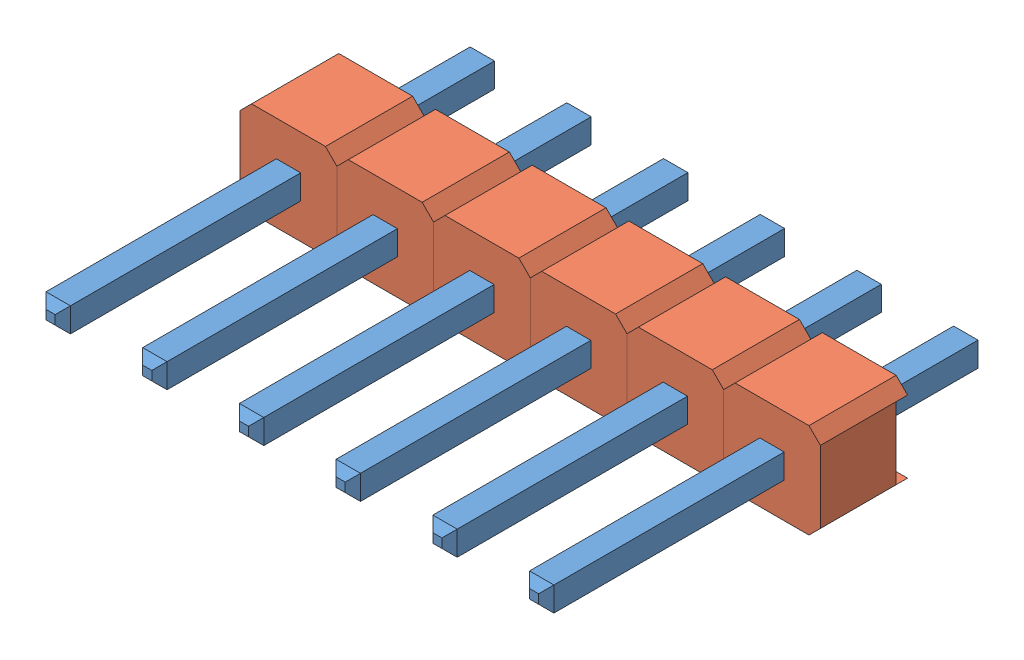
SolidWorks assembly User Library-Header_Male_6Pin.sldasm, configuration Default (file format 13000). Lengths in mm.
Overall size (15.24 2.49 11.54).
2 component instances, 2 part files, 0 mates.
Components (placement in the parent):
- User Library-Header_Male_6Pin_PinArray-1: User Library-Header_Male_6Pin_PinArray.sldprt [Default] at origin size (13.34 0.64 11.54)
- User Library-Header_Male_6Pin_BodyArray-1: User Library-Header_Male_6Pin_BodyArray.sldprt [Default] at origin size (15.24 2.49 2.29)
